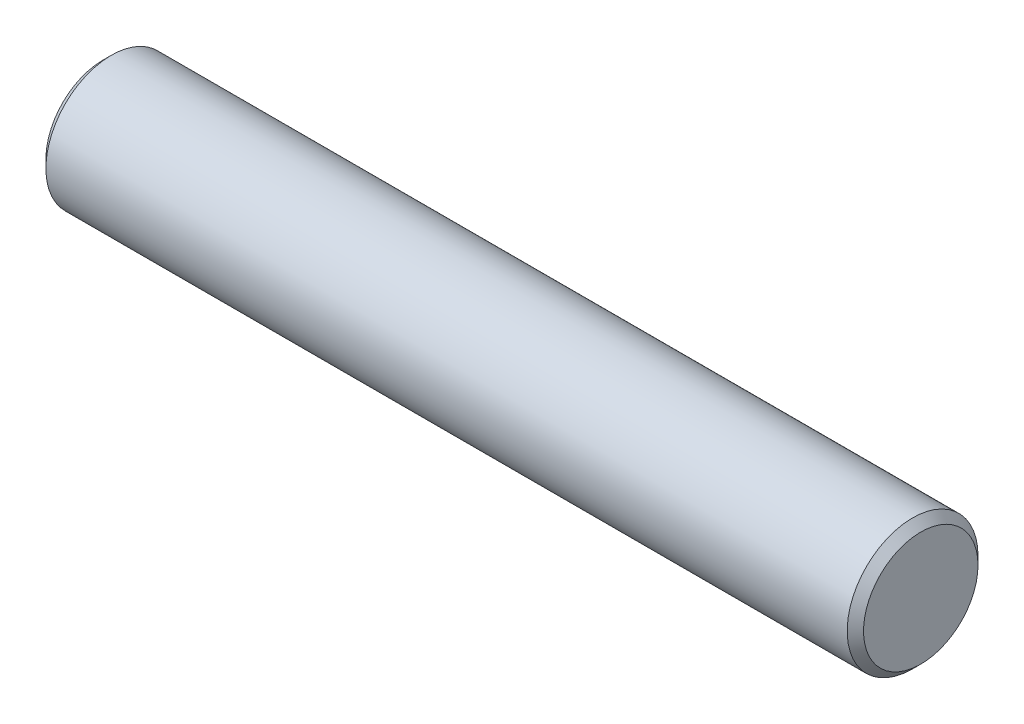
from build123d import *


with BuildPart() as part:
    # Esquisse1 → R_volution1 (revolve)
    with BuildSketch(Plane.XY, mode=Mode.PRIVATE) as r_volution1_sk:
        Polygon((0, 0), (50, 0), (50, 3.5), (49.5, 4), (0.5, 4), (0, 3.5), align=None)
    revolve(r_volution1_sk.sketch.rotate(Axis((110.45361528, 0, 0), (-1, 0, 0)), 90), axis=Axis((110.45361528, 0, 0), (-1, 0, 0)))


solid = part.part
